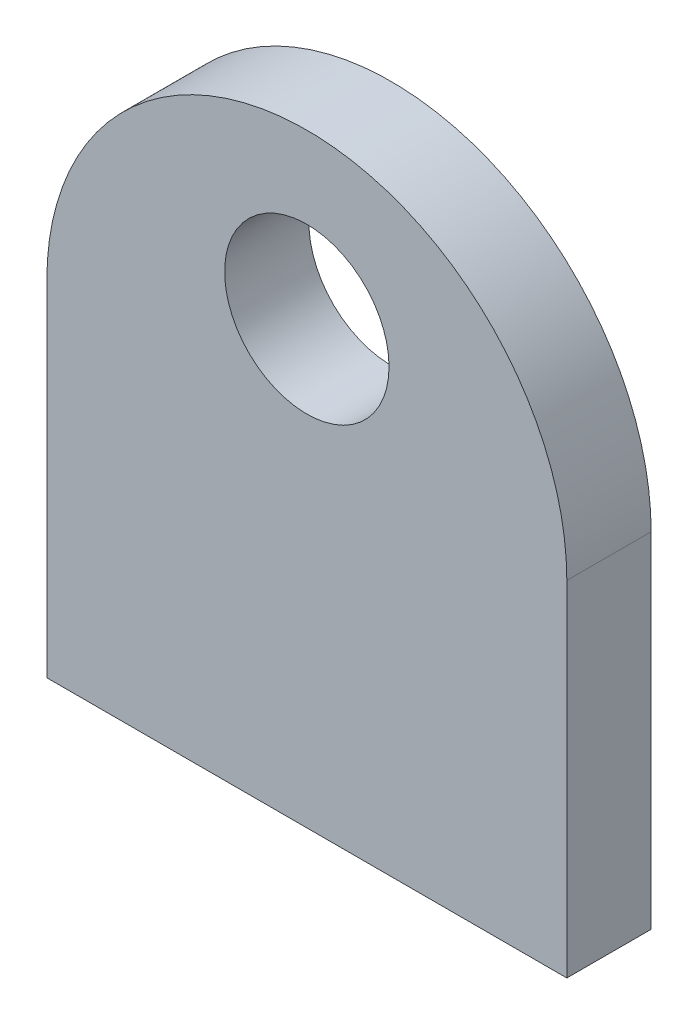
ISO-10303-21;
HEADER;
FILE_DESCRIPTION(('STEP AP214'),'2;1');
FILE_NAME('part.step','',(''),(''),'','','');
FILE_SCHEMA(('AUTOMOTIVE_DESIGN { 1 0 10303 214 1 1 1 1 }'));
ENDSEC;
DATA;
#1=APPLICATION_CONTEXT('core data for automotive mechanical design processes');
#2=APPLICATION_PROTOCOL_DEFINITION('international standard','automotive_design',2000,#1);
#3=PRODUCT_CONTEXT('',#1,'mechanical');
#4=PRODUCT('Part','Part','',(#3));
#5=PRODUCT_RELATED_PRODUCT_CATEGORY('part','',(#4));
#6=PRODUCT_DEFINITION_FORMATION('','',#4);
#7=PRODUCT_DEFINITION_CONTEXT('part definition',#1,'design');
#8=PRODUCT_DEFINITION('design','',#6,#7);
#9=PRODUCT_DEFINITION_SHAPE('','',#8);
#10=(LENGTH_UNIT() NAMED_UNIT(*) SI_UNIT(.MILLI.,.METRE.));
#11=(NAMED_UNIT(*) PLANE_ANGLE_UNIT() SI_UNIT($,.RADIAN.));
#12=(NAMED_UNIT(*) SI_UNIT($,.STERADIAN.) SOLID_ANGLE_UNIT());
#13=UNCERTAINTY_MEASURE_WITH_UNIT(LENGTH_MEASURE(1.E-05),#10,'distance_accuracy_value','');
#14=(GEOMETRIC_REPRESENTATION_CONTEXT(3) GLOBAL_UNCERTAINTY_ASSIGNED_CONTEXT((#13)) GLOBAL_UNIT_ASSIGNED_CONTEXT((#10,
#11,#12)) REPRESENTATION_CONTEXT('',''));
#15=CARTESIAN_POINT('',(0.,0.,0.));
#16=DIRECTION('',(0.,0.,1.));
#17=DIRECTION('',(1.,0.,0.));
#18=AXIS2_PLACEMENT_3D('',#15,#16,#17);
#19=CARTESIAN_POINT('',(-9.11039540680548,0.,6.));
#20=DIRECTION('',(-1.,0.,0.));
#21=DIRECTION('',(0.,-1.,0.));
#22=AXIS2_PLACEMENT_3D('',#19,#20,#21);
#23=PLANE('',#22);
#24=DIRECTION('',(0.,0.,-1.));
#25=VECTOR('',#24,1.);
#26=CARTESIAN_POINT('',(-9.11039540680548,0.,6.));
#27=LINE('',#26,#25);
#28=CARTESIAN_POINT('',(-9.11039540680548,0.,6.));
#29=VERTEX_POINT('',#28);
#30=CARTESIAN_POINT('',(-9.11039540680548,0.,0.));
#31=VERTEX_POINT('',#30);
#32=EDGE_CURVE('E94',#29,#31,#27,.T.);
#33=ORIENTED_EDGE('',*,*,#32,.F.);
#34=DIRECTION('',(0.,1.,0.));
#35=VECTOR('',#34,1.);
#36=CARTESIAN_POINT('',(-9.11039540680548,-22.5,6.));
#37=LINE('',#36,#35);
#38=CARTESIAN_POINT('',(-9.11039540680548,-24.5,6.));
#39=VERTEX_POINT('',#38);
#40=EDGE_CURVE('E50',#39,#29,#37,.T.);
#41=ORIENTED_EDGE('',*,*,#40,.F.);
#42=DIRECTION('',(0.,0.,-1.));
#43=VECTOR('',#42,1.);
#44=CARTESIAN_POINT('',(-9.11039540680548,-24.5,6.));
#45=LINE('',#44,#43);
#46=CARTESIAN_POINT('',(-9.11039540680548,-24.5,0.));
#47=VERTEX_POINT('',#46);
#48=EDGE_CURVE('E91',#39,#47,#45,.T.);
#49=ORIENTED_EDGE('',*,*,#48,.T.);
#50=DIRECTION('',(0.,1.,0.));
#51=VECTOR('',#50,1.);
#52=CARTESIAN_POINT('',(-9.11039540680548,0.,0.));
#53=LINE('',#52,#51);
#54=EDGE_CURVE('E67',#47,#31,#53,.T.);
#55=ORIENTED_EDGE('',*,*,#54,.T.);
#56=EDGE_LOOP('',(#33,#41,#49,#55));
#57=FACE_BOUND('',#56,.T.);
#58=ADVANCED_FACE('F33',(#57),#23,.F.);
#59=CARTESIAN_POINT('',(-27.6103954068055,0.,6.));
#60=DIRECTION('',(0.,0.,1.));
#61=DIRECTION('',(1.,0.,0.));
#62=AXIS2_PLACEMENT_3D('',#59,#60,#61);
#63=PLANE('',#62);
#64=CARTESIAN_POINT('',(-27.6103954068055,6.85,6.));
#65=DIRECTION('',(0.,0.,1.));
#66=DIRECTION('',(1.,0.,0.));
#67=AXIS2_PLACEMENT_3D('',#64,#65,#66);
#68=CIRCLE('',#67,5.85);
#69=CARTESIAN_POINT('',(-21.7603954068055,6.85,6.));
#70=VERTEX_POINT('',#69);
#71=EDGE_CURVE('E101',#70,#70,#68,.T.);
#72=ORIENTED_EDGE('',*,*,#71,.F.);
#73=EDGE_LOOP('',(#72));
#74=FACE_BOUND('',#73,.T.);
#75=DIRECTION('',(0.,-1.,0.));
#76=VECTOR('',#75,1.);
#77=CARTESIAN_POINT('',(-46.1103954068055,0.,6.));
#78=LINE('',#77,#76);
#79=CARTESIAN_POINT('',(-46.1103954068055,0.,6.));
#80=VERTEX_POINT('',#79);
#81=CARTESIAN_POINT('',(-46.1103954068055,-24.5,6.));
#82=VERTEX_POINT('',#81);
#83=EDGE_CURVE('E78',#80,#82,#78,.T.);
#84=ORIENTED_EDGE('',*,*,#83,.T.);
#85=DIRECTION('',(1.,0.,0.));
#86=VECTOR('',#85,1.);
#87=CARTESIAN_POINT('',(-9.11039540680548,-24.5,6.));
#88=LINE('',#87,#86);
#89=EDGE_CURVE('E81',#82,#39,#88,.T.);
#90=ORIENTED_EDGE('',*,*,#89,.T.);
#91=ORIENTED_EDGE('',*,*,#40,.T.);
#92=CARTESIAN_POINT('',(-27.6103954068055,0.,6.));
#93=DIRECTION('',(0.,0.,1.));
#94=DIRECTION('',(1.,0.,0.));
#95=AXIS2_PLACEMENT_3D('',#92,#93,#94);
#96=CIRCLE('',#95,18.5);
#97=EDGE_CURVE('E84',#29,#80,#96,.T.);
#98=ORIENTED_EDGE('',*,*,#97,.T.);
#99=EDGE_LOOP('',(#84,#90,#91,#98));
#100=FACE_BOUND('',#99,.T.);
#101=ADVANCED_FACE('F79',(#74,#100),#63,.T.);
#102=CARTESIAN_POINT('',(-27.6103954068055,0.,0.));
#103=DIRECTION('',(0.,0.,1.));
#104=DIRECTION('',(1.,0.,0.));
#105=AXIS2_PLACEMENT_3D('',#102,#103,#104);
#106=PLANE('',#105);
#107=CARTESIAN_POINT('',(-27.6103954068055,0.,0.));
#108=DIRECTION('',(0.,0.,1.));
#109=DIRECTION('',(1.,0.,0.));
#110=AXIS2_PLACEMENT_3D('',#107,#108,#109);
#111=CIRCLE('',#110,18.5);
#112=CARTESIAN_POINT('',(-46.1103954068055,0.,0.));
#113=VERTEX_POINT('',#112);
#114=EDGE_CURVE('E98',#31,#113,#111,.T.);
#115=ORIENTED_EDGE('',*,*,#114,.F.);
#116=ORIENTED_EDGE('',*,*,#54,.F.);
#117=DIRECTION('',(1.,0.,0.));
#118=VECTOR('',#117,1.);
#119=CARTESIAN_POINT('',(-9.11039540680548,-24.5,0.));
#120=LINE('',#119,#118);
#121=CARTESIAN_POINT('',(-46.1103954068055,-24.5,0.));
#122=VERTEX_POINT('',#121);
#123=EDGE_CURVE('E103',#122,#47,#120,.T.);
#124=ORIENTED_EDGE('',*,*,#123,.F.);
#125=DIRECTION('',(0.,-1.,0.));
#126=VECTOR('',#125,1.);
#127=CARTESIAN_POINT('',(-46.1103954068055,-24.5,0.));
#128=LINE('',#127,#126);
#129=EDGE_CURVE('E89',#113,#122,#128,.T.);
#130=ORIENTED_EDGE('',*,*,#129,.F.);
#131=EDGE_LOOP('',(#115,#116,#124,#130));
#132=FACE_BOUND('',#131,.T.);
#133=CARTESIAN_POINT('',(-27.6103954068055,6.85,0.));
#134=DIRECTION('',(0.,0.,1.));
#135=DIRECTION('',(1.,0.,0.));
#136=AXIS2_PLACEMENT_3D('',#133,#134,#135);
#137=CIRCLE('',#136,5.85);
#138=CARTESIAN_POINT('',(-21.7603954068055,6.85,0.));
#139=VERTEX_POINT('',#138);
#140=EDGE_CURVE('E109',#139,#139,#137,.T.);
#141=ORIENTED_EDGE('',*,*,#140,.T.);
#142=EDGE_LOOP('',(#141));
#143=FACE_BOUND('',#142,.T.);
#144=ADVANCED_FACE('F119',(#132,#143),#106,.F.);
#145=CARTESIAN_POINT('',(-27.6103954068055,0.,6.));
#146=DIRECTION('',(0.,0.,-1.));
#147=DIRECTION('',(-1.,0.,0.));
#148=AXIS2_PLACEMENT_3D('',#145,#146,#147);
#149=CYLINDRICAL_SURFACE('',#148,18.5);
#150=ORIENTED_EDGE('',*,*,#114,.T.);
#151=DIRECTION('',(0.,0.,-1.));
#152=VECTOR('',#151,1.);
#153=CARTESIAN_POINT('',(-46.1103954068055,0.,6.));
#154=LINE('',#153,#152);
#155=EDGE_CURVE('E11',#80,#113,#154,.T.);
#156=ORIENTED_EDGE('',*,*,#155,.F.);
#157=ORIENTED_EDGE('',*,*,#97,.F.);
#158=ORIENTED_EDGE('',*,*,#32,.T.);
#159=EDGE_LOOP('',(#150,#156,#157,#158));
#160=FACE_BOUND('',#159,.T.);
#161=ADVANCED_FACE('F35',(#160),#149,.T.);
#162=CARTESIAN_POINT('',(-46.1103954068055,-24.5,6.));
#163=DIRECTION('',(1.,0.,0.));
#164=DIRECTION('',(0.,0.,-1.));
#165=AXIS2_PLACEMENT_3D('',#162,#163,#164);
#166=PLANE('',#165);
#167=DIRECTION('',(0.,0.,-1.));
#168=VECTOR('',#167,1.);
#169=CARTESIAN_POINT('',(-46.1103954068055,-24.5,6.));
#170=LINE('',#169,#168);
#171=EDGE_CURVE('E42',#82,#122,#170,.T.);
#172=ORIENTED_EDGE('',*,*,#171,.F.);
#173=ORIENTED_EDGE('',*,*,#83,.F.);
#174=ORIENTED_EDGE('',*,*,#155,.T.);
#175=ORIENTED_EDGE('',*,*,#129,.T.);
#176=EDGE_LOOP('',(#172,#173,#174,#175));
#177=FACE_BOUND('',#176,.T.);
#178=ADVANCED_FACE('F88',(#177),#166,.F.);
#179=CARTESIAN_POINT('',(-9.11039540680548,-24.5,6.));
#180=DIRECTION('',(0.,1.,0.));
#181=DIRECTION('',(0.,0.,1.));
#182=AXIS2_PLACEMENT_3D('',#179,#180,#181);
#183=PLANE('',#182);
#184=ORIENTED_EDGE('',*,*,#123,.T.);
#185=ORIENTED_EDGE('',*,*,#48,.F.);
#186=ORIENTED_EDGE('',*,*,#89,.F.);
#187=ORIENTED_EDGE('',*,*,#171,.T.);
#188=EDGE_LOOP('',(#184,#185,#186,#187));
#189=FACE_BOUND('',#188,.T.);
#190=ADVANCED_FACE('F92',(#189),#183,.F.);
#191=CARTESIAN_POINT('',(-27.6103954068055,6.85,6.));
#192=DIRECTION('',(0.,0.,-1.));
#193=DIRECTION('',(-1.,0.,0.));
#194=AXIS2_PLACEMENT_3D('',#191,#192,#193);
#195=CYLINDRICAL_SURFACE('',#194,5.85);
#196=ORIENTED_EDGE('',*,*,#71,.T.);
#197=EDGE_LOOP('',(#196));
#198=FACE_BOUND('',#197,.T.);
#199=ORIENTED_EDGE('',*,*,#140,.F.);
#200=EDGE_LOOP('',(#199));
#201=FACE_BOUND('',#200,.T.);
#202=ADVANCED_FACE('F115',(#198,#201),#195,.F.);
#203=CLOSED_SHELL('',(#58,#101,#144,#161,#178,#190,#202));
#204=MANIFOLD_SOLID_BREP('B2',#203);
#205=ADVANCED_BREP_SHAPE_REPRESENTATION('',(#18,#204),#14);
#206=SHAPE_DEFINITION_REPRESENTATION(#9,#205);
ENDSEC;
END-ISO-10303-21;
